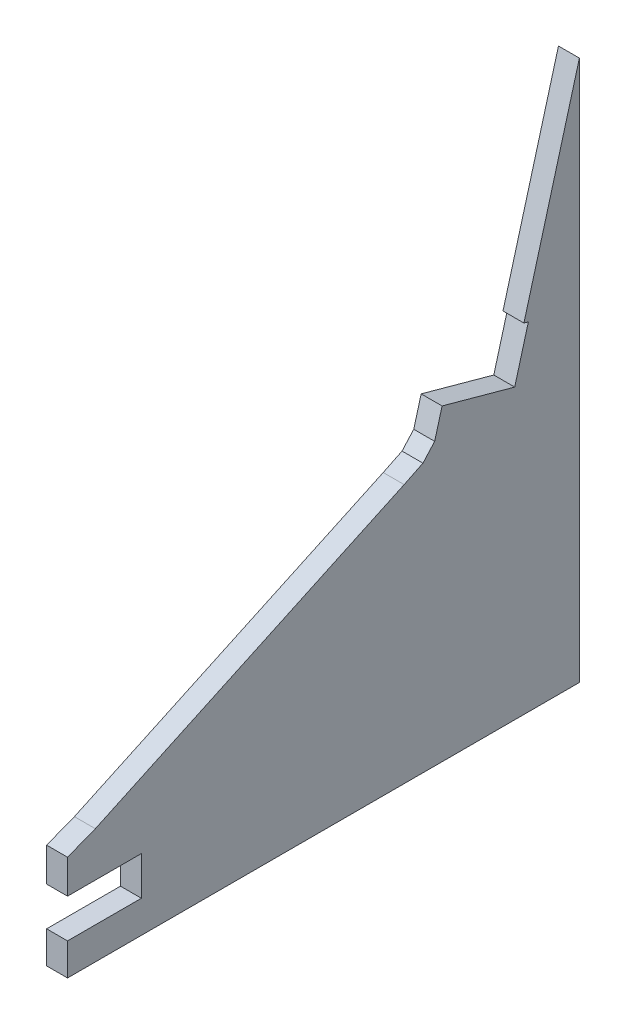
ISO-10303-21;
HEADER;
FILE_DESCRIPTION(('STEP AP214'),'2;1');
FILE_NAME('part.step','',(''),(''),'','','');
FILE_SCHEMA(('AUTOMOTIVE_DESIGN { 1 0 10303 214 1 1 1 1 }'));
ENDSEC;
DATA;
#1=APPLICATION_CONTEXT('core data for automotive mechanical design processes');
#2=APPLICATION_PROTOCOL_DEFINITION('international standard','automotive_design',2000,#1);
#3=PRODUCT_CONTEXT('',#1,'mechanical');
#4=PRODUCT('Part','Part','',(#3));
#5=PRODUCT_RELATED_PRODUCT_CATEGORY('part','',(#4));
#6=PRODUCT_DEFINITION_FORMATION('','',#4);
#7=PRODUCT_DEFINITION_CONTEXT('part definition',#1,'design');
#8=PRODUCT_DEFINITION('design','',#6,#7);
#9=PRODUCT_DEFINITION_SHAPE('','',#8);
#10=(LENGTH_UNIT() NAMED_UNIT(*) SI_UNIT(.MILLI.,.METRE.));
#11=(NAMED_UNIT(*) PLANE_ANGLE_UNIT() SI_UNIT($,.RADIAN.));
#12=(NAMED_UNIT(*) SI_UNIT($,.STERADIAN.) SOLID_ANGLE_UNIT());
#13=UNCERTAINTY_MEASURE_WITH_UNIT(LENGTH_MEASURE(1.E-05),#10,'distance_accuracy_value','');
#14=(GEOMETRIC_REPRESENTATION_CONTEXT(3) GLOBAL_UNCERTAINTY_ASSIGNED_CONTEXT((#13)) GLOBAL_UNIT_ASSIGNED_CONTEXT((#10,
#11,#12)) REPRESENTATION_CONTEXT('',''));
#15=CARTESIAN_POINT('',(0.,0.,0.));
#16=DIRECTION('',(0.,0.,1.));
#17=DIRECTION('',(1.,0.,0.));
#18=AXIS2_PLACEMENT_3D('',#15,#16,#17);
#19=CARTESIAN_POINT('',(10.,-748.435272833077,-112.051223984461));
#20=DIRECTION('',(0.,1.,0.));
#21=DIRECTION('',(0.,0.,1.));
#22=AXIS2_PLACEMENT_3D('',#19,#20,#21);
#23=PLANE('',#22);
#24=DIRECTION('',(0.,0.,-1.));
#25=VECTOR('',#24,1.);
#26=CARTESIAN_POINT('',(0.,-748.435272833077,-112.051223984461));
#27=LINE('',#26,#25);
#28=CARTESIAN_POINT('',(0.,-748.435272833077,132.594000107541));
#29=VERTEX_POINT('',#28);
#30=CARTESIAN_POINT('',(0.,-748.435272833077,-112.051223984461));
#31=VERTEX_POINT('',#30);
#32=EDGE_CURVE('E177',#29,#31,#27,.T.);
#33=ORIENTED_EDGE('',*,*,#32,.T.);
#34=DIRECTION('',(-1.,0.,0.));
#35=VECTOR('',#34,1.);
#36=CARTESIAN_POINT('',(10.,-748.435272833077,-112.051223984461));
#37=LINE('',#36,#35);
#38=CARTESIAN_POINT('',(10.,-748.435272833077,-112.051223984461));
#39=VERTEX_POINT('',#38);
#40=EDGE_CURVE('E11',#39,#31,#37,.T.);
#41=ORIENTED_EDGE('',*,*,#40,.F.);
#42=DIRECTION('',(0.,0.,-1.));
#43=VECTOR('',#42,1.);
#44=CARTESIAN_POINT('',(10.,-748.435272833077,-112.051223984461));
#45=LINE('',#44,#43);
#46=CARTESIAN_POINT('',(10.,-748.435272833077,132.594000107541));
#47=VERTEX_POINT('',#46);
#48=EDGE_CURVE('E207',#47,#39,#45,.T.);
#49=ORIENTED_EDGE('',*,*,#48,.F.);
#50=DIRECTION('',(-1.,0.,0.));
#51=VECTOR('',#50,1.);
#52=CARTESIAN_POINT('',(10.,-748.435272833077,132.594000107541));
#53=LINE('',#52,#51);
#54=EDGE_CURVE('E173',#47,#29,#53,.T.);
#55=ORIENTED_EDGE('',*,*,#54,.T.);
#56=EDGE_LOOP('',(#33,#41,#49,#55));
#57=FACE_BOUND('',#56,.T.);
#58=ADVANCED_FACE('F33',(#57),#23,.F.);
#59=CARTESIAN_POINT('',(10.,-489.980067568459,-112.051223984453));
#60=DIRECTION('',(0.,0.,1.));
#61=DIRECTION('',(0.,-1.,0.));
#62=AXIS2_PLACEMENT_3D('',#59,#60,#61);
#63=PLANE('',#62);
#64=DIRECTION('',(0.,1.,0.));
#65=VECTOR('',#64,1.);
#66=CARTESIAN_POINT('',(0.,-489.980067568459,-112.051223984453));
#67=LINE('',#66,#65);
#68=CARTESIAN_POINT('',(0.,-489.980067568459,-112.051223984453));
#69=VERTEX_POINT('',#68);
#70=EDGE_CURVE('E180',#31,#69,#67,.T.);
#71=ORIENTED_EDGE('',*,*,#70,.T.);
#72=DIRECTION('',(-1.,0.,0.));
#73=VECTOR('',#72,1.);
#74=CARTESIAN_POINT('',(10.,-489.980067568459,-112.051223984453));
#75=LINE('',#74,#73);
#76=CARTESIAN_POINT('',(10.,-489.980067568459,-112.051223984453));
#77=VERTEX_POINT('',#76);
#78=EDGE_CURVE('E41',#77,#69,#75,.T.);
#79=ORIENTED_EDGE('',*,*,#78,.F.);
#80=DIRECTION('',(0.,1.,0.));
#81=VECTOR('',#80,1.);
#82=CARTESIAN_POINT('',(10.,-489.980067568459,-112.051223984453));
#83=LINE('',#82,#81);
#84=EDGE_CURVE('E116',#39,#77,#83,.T.);
#85=ORIENTED_EDGE('',*,*,#84,.F.);
#86=ORIENTED_EDGE('',*,*,#40,.T.);
#87=EDGE_LOOP('',(#71,#79,#85,#86));
#88=FACE_BOUND('',#87,.T.);
#89=ADVANCED_FACE('F305',(#88),#63,.F.);
#90=CARTESIAN_POINT('',(10.,-489.980067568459,-112.051223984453));
#91=DIRECTION('',(0.,-0.265140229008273,-0.964209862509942));
#92=DIRECTION('',(0.,0.964209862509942,-0.265140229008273));
#93=AXIS2_PLACEMENT_3D('',#90,#91,#92);
#94=PLANE('',#93);
#95=DIRECTION('',(0.,-0.964209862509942,0.265140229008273));
#96=VECTOR('',#95,1.);
#97=CARTESIAN_POINT('',(0.,-489.980067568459,-112.051223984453));
#98=LINE('',#97,#96);
#99=CARTESIAN_POINT('',(0.,-586.401053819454,-85.5372010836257));
#100=VERTEX_POINT('',#99);
#101=EDGE_CURVE('E182',#69,#100,#98,.T.);
#102=ORIENTED_EDGE('',*,*,#101,.T.);
#103=DIRECTION('',(-1.,0.,0.));
#104=VECTOR('',#103,1.);
#105=CARTESIAN_POINT('',(10.,-586.401053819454,-85.5372010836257));
#106=LINE('',#105,#104);
#107=CARTESIAN_POINT('',(10.,-586.401053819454,-85.5372010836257));
#108=VERTEX_POINT('',#107);
#109=EDGE_CURVE('E238',#108,#100,#106,.T.);
#110=ORIENTED_EDGE('',*,*,#109,.F.);
#111=DIRECTION('',(0.,-0.964209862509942,0.265140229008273));
#112=VECTOR('',#111,1.);
#113=CARTESIAN_POINT('',(10.,-489.980067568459,-112.051223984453));
#114=LINE('',#113,#112);
#115=EDGE_CURVE('E246',#77,#108,#114,.T.);
#116=ORIENTED_EDGE('',*,*,#115,.F.);
#117=ORIENTED_EDGE('',*,*,#78,.T.);
#118=EDGE_LOOP('',(#102,#110,#116,#117));
#119=FACE_BOUND('',#118,.T.);
#120=ADVANCED_FACE('F244',(#119),#94,.F.);
#121=CARTESIAN_POINT('',(10.,-586.984361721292,-87.658460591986));
#122=DIRECTION('',(0.,0.964209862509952,-0.265140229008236));
#123=DIRECTION('',(0.,0.265140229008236,0.964209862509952));
#124=AXIS2_PLACEMENT_3D('',#121,#122,#123);
#125=PLANE('',#124);
#126=DIRECTION('',(0.,-0.265140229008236,-0.964209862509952));
#127=VECTOR('',#126,1.);
#128=CARTESIAN_POINT('',(0.,-586.984361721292,-87.658460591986));
#129=LINE('',#128,#127);
#130=CARTESIAN_POINT('',(0.,-586.984361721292,-87.658460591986));
#131=VERTEX_POINT('',#130);
#132=EDGE_CURVE('E184',#100,#131,#129,.T.);
#133=ORIENTED_EDGE('',*,*,#132,.T.);
#134=DIRECTION('',(-1.,0.,0.));
#135=VECTOR('',#134,1.);
#136=CARTESIAN_POINT('',(10.,-586.984361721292,-87.658460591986));
#137=LINE('',#136,#135);
#138=CARTESIAN_POINT('',(10.,-586.984361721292,-87.658460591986));
#139=VERTEX_POINT('',#138);
#140=EDGE_CURVE('E235',#139,#131,#137,.T.);
#141=ORIENTED_EDGE('',*,*,#140,.F.);
#142=DIRECTION('',(0.,-0.265140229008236,-0.964209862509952));
#143=VECTOR('',#142,1.);
#144=CARTESIAN_POINT('',(10.,-586.984361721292,-87.658460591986));
#145=LINE('',#144,#143);
#146=EDGE_CURVE('E264',#108,#139,#145,.T.);
#147=ORIENTED_EDGE('',*,*,#146,.F.);
#148=ORIENTED_EDGE('',*,*,#109,.T.);
#149=EDGE_LOOP('',(#133,#141,#147,#148));
#150=FACE_BOUND('',#149,.T.);
#151=ADVANCED_FACE('F255',(#150),#125,.F.);
#152=CARTESIAN_POINT('',(10.,-586.984361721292,-87.658460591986));
#153=DIRECTION('',(0.,-0.265140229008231,-0.964209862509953));
#154=DIRECTION('',(0.,0.964209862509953,-0.265140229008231));
#155=AXIS2_PLACEMENT_3D('',#152,#153,#154);
#156=PLANE('',#155);
#157=DIRECTION('',(0.,-0.964209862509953,0.265140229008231));
#158=VECTOR('',#157,1.);
#159=CARTESIAN_POINT('',(0.,-586.984361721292,-87.658460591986));
#160=LINE('',#159,#158);
#161=CARTESIAN_POINT('',(0.,-610.703922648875,-81.1360114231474));
#162=VERTEX_POINT('',#161);
#163=EDGE_CURVE('E186',#131,#162,#160,.T.);
#164=ORIENTED_EDGE('',*,*,#163,.T.);
#165=DIRECTION('',(-1.,0.,0.));
#166=VECTOR('',#165,1.);
#167=CARTESIAN_POINT('',(10.,-610.703922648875,-81.1360114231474));
#168=LINE('',#167,#166);
#169=CARTESIAN_POINT('',(10.,-610.703922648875,-81.1360114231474));
#170=VERTEX_POINT('',#169);
#171=EDGE_CURVE('E232',#170,#162,#168,.T.);
#172=ORIENTED_EDGE('',*,*,#171,.F.);
#173=DIRECTION('',(0.,-0.964209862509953,0.265140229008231));
#174=VECTOR('',#173,1.);
#175=CARTESIAN_POINT('',(10.,-586.984361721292,-87.658460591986));
#176=LINE('',#175,#174);
#177=EDGE_CURVE('E261',#139,#170,#176,.T.);
#178=ORIENTED_EDGE('',*,*,#177,.F.);
#179=ORIENTED_EDGE('',*,*,#140,.T.);
#180=EDGE_LOOP('',(#164,#172,#178,#179));
#181=FACE_BOUND('',#180,.T.);
#182=ADVANCED_FACE('F259',(#181),#156,.F.);
#183=CARTESIAN_POINT('',(10.,-610.703922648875,-81.1360114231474));
#184=DIRECTION('',(0.,-0.964209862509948,0.26514022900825));
#185=DIRECTION('',(0.,-0.26514022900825,-0.964209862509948));
#186=AXIS2_PLACEMENT_3D('',#183,#184,#185);
#187=PLANE('',#186);
#188=DIRECTION('',(0.,0.26514022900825,0.964209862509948));
#189=VECTOR('',#188,1.);
#190=CARTESIAN_POINT('',(0.,-610.703922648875,-81.1360114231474));
#191=LINE('',#190,#189);
#192=CARTESIAN_POINT('',(0.,-601.158874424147,-46.4244564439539));
#193=VERTEX_POINT('',#192);
#194=EDGE_CURVE('E188',#162,#193,#191,.T.);
#195=ORIENTED_EDGE('',*,*,#194,.T.);
#196=DIRECTION('',(-1.,0.,0.));
#197=VECTOR('',#196,1.);
#198=CARTESIAN_POINT('',(10.,-601.158874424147,-46.4244564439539));
#199=LINE('',#198,#197);
#200=CARTESIAN_POINT('',(10.,-601.158874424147,-46.4244564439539));
#201=VERTEX_POINT('',#200);
#202=EDGE_CURVE('E229',#201,#193,#199,.T.);
#203=ORIENTED_EDGE('',*,*,#202,.F.);
#204=DIRECTION('',(0.,0.26514022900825,0.964209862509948));
#205=VECTOR('',#204,1.);
#206=CARTESIAN_POINT('',(10.,-610.703922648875,-81.1360114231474));
#207=LINE('',#206,#205);
#208=EDGE_CURVE('E263',#170,#201,#207,.T.);
#209=ORIENTED_EDGE('',*,*,#208,.F.);
#210=ORIENTED_EDGE('',*,*,#171,.T.);
#211=EDGE_LOOP('',(#195,#203,#209,#210));
#212=FACE_BOUND('',#211,.T.);
#213=ADVANCED_FACE('F318',(#212),#187,.F.);
#214=CARTESIAN_POINT('',(10.,-601.158874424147,-46.4244564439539));
#215=DIRECTION('',(0.,-0.265140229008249,-0.964209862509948));
#216=DIRECTION('',(0.,0.964209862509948,-0.265140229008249));
#217=AXIS2_PLACEMENT_3D('',#214,#215,#216);
#218=PLANE('',#217);
#219=DIRECTION('',(0.,-0.964209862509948,0.265140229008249));
#220=VECTOR('',#219,1.);
#221=CARTESIAN_POINT('',(0.,-601.158874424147,-46.4244564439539));
#222=LINE('',#221,#220);
#223=CARTESIAN_POINT('',(0.,-614.040719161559,-42.8821827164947));
#224=VERTEX_POINT('',#223);
#225=EDGE_CURVE('E190',#193,#224,#222,.T.);
#226=ORIENTED_EDGE('',*,*,#225,.T.);
#227=DIRECTION('',(-1.,0.,0.));
#228=VECTOR('',#227,1.);
#229=CARTESIAN_POINT('',(10.,-614.040719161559,-42.8821827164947));
#230=LINE('',#229,#228);
#231=CARTESIAN_POINT('',(10.,-614.040719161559,-42.8821827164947));
#232=VERTEX_POINT('',#231);
#233=EDGE_CURVE('E226',#232,#224,#230,.T.);
#234=ORIENTED_EDGE('',*,*,#233,.F.);
#235=DIRECTION('',(0.,-0.964209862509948,0.265140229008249));
#236=VECTOR('',#235,1.);
#237=CARTESIAN_POINT('',(10.,-601.158874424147,-46.4244564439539));
#238=LINE('',#237,#236);
#239=EDGE_CURVE('E266',#201,#232,#238,.T.);
#240=ORIENTED_EDGE('',*,*,#239,.F.);
#241=ORIENTED_EDGE('',*,*,#202,.T.);
#242=EDGE_LOOP('',(#226,#234,#240,#241));
#243=FACE_BOUND('',#242,.T.);
#244=ADVANCED_FACE('F321',(#243),#218,.F.);
#245=CARTESIAN_POINT('',(10.,-614.040719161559,-42.8821827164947));
#246=DIRECTION('',(0.,-0.668355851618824,-0.743841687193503));
#247=DIRECTION('',(0.,0.743841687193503,-0.668355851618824));
#248=AXIS2_PLACEMENT_3D('',#245,#246,#247);
#249=PLANE('',#248);
#250=DIRECTION('',(0.,-0.743841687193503,0.668355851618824));
#251=VECTOR('',#250,1.);
#252=CARTESIAN_POINT('',(0.,-614.040719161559,-42.8821827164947));
#253=LINE('',#252,#251);
#254=CARTESIAN_POINT('',(0.,-620.270284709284,-37.284800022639));
#255=VERTEX_POINT('',#254);
#256=EDGE_CURVE('E192',#224,#255,#253,.T.);
#257=ORIENTED_EDGE('',*,*,#256,.T.);
#258=DIRECTION('',(-1.,0.,0.));
#259=VECTOR('',#258,1.);
#260=CARTESIAN_POINT('',(10.,-620.270284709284,-37.284800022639));
#261=LINE('',#260,#259);
#262=CARTESIAN_POINT('',(10.,-620.270284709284,-37.284800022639));
#263=VERTEX_POINT('',#262);
#264=EDGE_CURVE('E223',#263,#255,#261,.T.);
#265=ORIENTED_EDGE('',*,*,#264,.F.);
#266=DIRECTION('',(0.,-0.743841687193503,0.668355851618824));
#267=VECTOR('',#266,1.);
#268=CARTESIAN_POINT('',(10.,-614.040719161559,-42.8821827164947));
#269=LINE('',#268,#267);
#270=EDGE_CURVE('E272',#232,#263,#269,.T.);
#271=ORIENTED_EDGE('',*,*,#270,.F.);
#272=ORIENTED_EDGE('',*,*,#233,.T.);
#273=EDGE_LOOP('',(#257,#265,#271,#272));
#274=FACE_BOUND('',#273,.T.);
#275=ADVANCED_FACE('F325',(#274),#249,.F.);
#276=CARTESIAN_POINT('',(10.,-624.646577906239,-28.2932452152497));
#277=DIRECTION('',(0.,-0.899155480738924,-0.437629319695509));
#278=DIRECTION('',(0.,0.437629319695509,-0.899155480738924));
#279=AXIS2_PLACEMENT_3D('',#276,#277,#278);
#280=PLANE('',#279);
#281=DIRECTION('',(0.,-0.437629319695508,0.899155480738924));
#282=VECTOR('',#281,1.);
#283=CARTESIAN_POINT('',(0.,-624.646577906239,-28.2932452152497));
#284=LINE('',#283,#282);
#285=CARTESIAN_POINT('',(0.,-624.646577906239,-28.2932452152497));
#286=VERTEX_POINT('',#285);
#287=EDGE_CURVE('E194',#255,#286,#284,.T.);
#288=ORIENTED_EDGE('',*,*,#287,.T.);
#289=DIRECTION('',(-1.,0.,0.));
#290=VECTOR('',#289,1.);
#291=CARTESIAN_POINT('',(10.,-624.646577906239,-28.2932452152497));
#292=LINE('',#291,#290);
#293=CARTESIAN_POINT('',(10.,-624.646577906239,-28.2932452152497));
#294=VERTEX_POINT('',#293);
#295=EDGE_CURVE('E220',#294,#286,#292,.T.);
#296=ORIENTED_EDGE('',*,*,#295,.F.);
#297=DIRECTION('',(0.,-0.437629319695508,0.899155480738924));
#298=VECTOR('',#297,1.);
#299=CARTESIAN_POINT('',(10.,-624.646577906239,-28.2932452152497));
#300=LINE('',#299,#298);
#301=EDGE_CURVE('E274',#263,#294,#300,.T.);
#302=ORIENTED_EDGE('',*,*,#301,.F.);
#303=ORIENTED_EDGE('',*,*,#264,.T.);
#304=EDGE_LOOP('',(#288,#296,#302,#303));
#305=FACE_BOUND('',#304,.T.);
#306=ADVANCED_FACE('F329',(#305),#280,.F.);
#307=CARTESIAN_POINT('',(10.,-624.646577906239,-28.2932452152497));
#308=DIRECTION('',(0.,-0.90675172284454,-0.42166492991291));
#309=DIRECTION('',(0.,0.42166492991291,-0.90675172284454));
#310=AXIS2_PLACEMENT_3D('',#307,#308,#309);
#311=PLANE('',#310);
#312=DIRECTION('',(0.,-0.42166492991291,0.906751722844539));
#313=VECTOR('',#312,1.);
#314=CARTESIAN_POINT('',(0.,-624.646577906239,-28.2932452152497));
#315=LINE('',#314,#313);
#316=CARTESIAN_POINT('',(0.,-693.286140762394,119.309833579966));
#317=VERTEX_POINT('',#316);
#318=EDGE_CURVE('E196',#286,#317,#315,.T.);
#319=ORIENTED_EDGE('',*,*,#318,.T.);
#320=DIRECTION('',(-1.,0.,0.));
#321=VECTOR('',#320,1.);
#322=CARTESIAN_POINT('',(10.,-693.286140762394,119.309833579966));
#323=LINE('',#322,#321);
#324=CARTESIAN_POINT('',(10.,-693.286140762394,119.309833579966));
#325=VERTEX_POINT('',#324);
#326=EDGE_CURVE('E217',#325,#317,#323,.T.);
#327=ORIENTED_EDGE('',*,*,#326,.F.);
#328=DIRECTION('',(0.,-0.42166492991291,0.906751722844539));
#329=VECTOR('',#328,1.);
#330=CARTESIAN_POINT('',(10.,-624.646577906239,-28.2932452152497));
#331=LINE('',#330,#329);
#332=EDGE_CURVE('E276',#294,#325,#331,.T.);
#333=ORIENTED_EDGE('',*,*,#332,.F.);
#334=ORIENTED_EDGE('',*,*,#295,.T.);
#335=EDGE_LOOP('',(#319,#327,#333,#334));
#336=FACE_BOUND('',#335,.T.);
#337=ADVANCED_FACE('F333',(#336),#311,.F.);
#338=CARTESIAN_POINT('',(10.,-693.286140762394,119.309833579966));
#339=DIRECTION('',(0.,-0.93240557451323,-0.361413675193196));
#340=DIRECTION('',(0.,0.361413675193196,-0.93240557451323));
#341=AXIS2_PLACEMENT_3D('',#338,#339,#340);
#342=PLANE('',#341);
#343=DIRECTION('',(0.,-0.361413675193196,0.93240557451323));
#344=VECTOR('',#343,1.);
#345=CARTESIAN_POINT('',(0.,-693.286140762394,119.309833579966));
#346=LINE('',#345,#344);
#347=CARTESIAN_POINT('',(0.,-698.435272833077,132.594000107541));
#348=VERTEX_POINT('',#347);
#349=EDGE_CURVE('E198',#317,#348,#346,.T.);
#350=ORIENTED_EDGE('',*,*,#349,.T.);
#351=DIRECTION('',(-1.,0.,0.));
#352=VECTOR('',#351,1.);
#353=CARTESIAN_POINT('',(10.,-698.435272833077,132.594000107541));
#354=LINE('',#353,#352);
#355=CARTESIAN_POINT('',(10.,-698.435272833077,132.594000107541));
#356=VERTEX_POINT('',#355);
#357=EDGE_CURVE('E214',#356,#348,#354,.T.);
#358=ORIENTED_EDGE('',*,*,#357,.F.);
#359=DIRECTION('',(0.,-0.361413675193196,0.93240557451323));
#360=VECTOR('',#359,1.);
#361=CARTESIAN_POINT('',(10.,-693.286140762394,119.309833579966));
#362=LINE('',#361,#360);
#363=EDGE_CURVE('E278',#325,#356,#362,.T.);
#364=ORIENTED_EDGE('',*,*,#363,.F.);
#365=ORIENTED_EDGE('',*,*,#326,.T.);
#366=EDGE_LOOP('',(#350,#358,#364,#365));
#367=FACE_BOUND('',#366,.T.);
#368=ADVANCED_FACE('F337',(#367),#342,.F.);
#369=CARTESIAN_POINT('',(10.,-698.435272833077,132.594000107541));
#370=DIRECTION('',(0.,0.,-1.));
#371=DIRECTION('',(-1.,0.,0.));
#372=AXIS2_PLACEMENT_3D('',#369,#370,#371);
#373=PLANE('',#372);
#374=DIRECTION('',(0.,-1.,0.));
#375=VECTOR('',#374,1.);
#376=CARTESIAN_POINT('',(0.,-698.435272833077,132.594000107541));
#377=LINE('',#376,#375);
#378=CARTESIAN_POINT('',(0.,-714.571297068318,132.594000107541));
#379=VERTEX_POINT('',#378);
#380=EDGE_CURVE('E200',#348,#379,#377,.T.);
#381=ORIENTED_EDGE('',*,*,#380,.T.);
#382=DIRECTION('',(-1.,0.,0.));
#383=VECTOR('',#382,1.);
#384=CARTESIAN_POINT('',(10.,-714.571297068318,132.594000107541));
#385=LINE('',#384,#383);
#386=CARTESIAN_POINT('',(10.,-714.571297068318,132.594000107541));
#387=VERTEX_POINT('',#386);
#388=EDGE_CURVE('E211',#387,#379,#385,.T.);
#389=ORIENTED_EDGE('',*,*,#388,.F.);
#390=DIRECTION('',(0.,-1.,0.));
#391=VECTOR('',#390,1.);
#392=CARTESIAN_POINT('',(10.,-698.435272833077,132.594000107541));
#393=LINE('',#392,#391);
#394=EDGE_CURVE('E280',#356,#387,#393,.T.);
#395=ORIENTED_EDGE('',*,*,#394,.F.);
#396=ORIENTED_EDGE('',*,*,#357,.T.);
#397=EDGE_LOOP('',(#381,#389,#395,#396));
#398=FACE_BOUND('',#397,.T.);
#399=ADVANCED_FACE('F286',(#398),#373,.F.);
#400=CARTESIAN_POINT('',(10.,-714.571297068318,97.2940001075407));
#401=DIRECTION('',(0.,1.,0.));
#402=DIRECTION('',(0.,0.,1.));
#403=AXIS2_PLACEMENT_3D('',#400,#401,#402);
#404=PLANE('',#403);
#405=DIRECTION('',(0.,0.,-1.));
#406=VECTOR('',#405,1.);
#407=CARTESIAN_POINT('',(0.,-714.571297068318,97.2940001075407));
#408=LINE('',#407,#406);
#409=CARTESIAN_POINT('',(0.,-714.571297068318,97.2940001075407));
#410=VERTEX_POINT('',#409);
#411=EDGE_CURVE('E202',#379,#410,#408,.T.);
#412=ORIENTED_EDGE('',*,*,#411,.T.);
#413=DIRECTION('',(-1.,0.,0.));
#414=VECTOR('',#413,1.);
#415=CARTESIAN_POINT('',(10.,-714.571297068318,97.2940001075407));
#416=LINE('',#415,#414);
#417=CARTESIAN_POINT('',(10.,-714.571297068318,97.2940001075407));
#418=VERTEX_POINT('',#417);
#419=EDGE_CURVE('E168',#418,#410,#416,.T.);
#420=ORIENTED_EDGE('',*,*,#419,.F.);
#421=DIRECTION('',(0.,0.,-1.));
#422=VECTOR('',#421,1.);
#423=CARTESIAN_POINT('',(10.,-714.571297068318,97.2940001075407));
#424=LINE('',#423,#422);
#425=EDGE_CURVE('E159',#387,#418,#424,.T.);
#426=ORIENTED_EDGE('',*,*,#425,.F.);
#427=ORIENTED_EDGE('',*,*,#388,.T.);
#428=EDGE_LOOP('',(#412,#420,#426,#427));
#429=FACE_BOUND('',#428,.T.);
#430=ADVANCED_FACE('F290',(#429),#404,.F.);
#431=CARTESIAN_POINT('',(10.,-714.571297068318,97.2940001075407));
#432=DIRECTION('',(0.,0.,-1.));
#433=DIRECTION('',(-1.,0.,0.));
#434=AXIS2_PLACEMENT_3D('',#431,#432,#433);
#435=PLANE('',#434);
#436=DIRECTION('',(0.,-1.,0.));
#437=VECTOR('',#436,1.);
#438=CARTESIAN_POINT('',(0.,-714.571297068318,97.2940001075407));
#439=LINE('',#438,#437);
#440=CARTESIAN_POINT('',(0.,-733.071297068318,97.2940001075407));
#441=VERTEX_POINT('',#440);
#442=EDGE_CURVE('E167',#410,#441,#439,.T.);
#443=ORIENTED_EDGE('',*,*,#442,.T.);
#444=DIRECTION('',(-1.,0.,0.));
#445=VECTOR('',#444,1.);
#446=CARTESIAN_POINT('',(10.,-733.071297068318,97.2940001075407));
#447=LINE('',#446,#445);
#448=CARTESIAN_POINT('',(10.,-733.071297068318,97.2940001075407));
#449=VERTEX_POINT('',#448);
#450=EDGE_CURVE('E164',#449,#441,#447,.T.);
#451=ORIENTED_EDGE('',*,*,#450,.F.);
#452=DIRECTION('',(0.,-1.,0.));
#453=VECTOR('',#452,1.);
#454=CARTESIAN_POINT('',(10.,-714.571297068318,97.2940001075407));
#455=LINE('',#454,#453);
#456=EDGE_CURVE('E153',#418,#449,#455,.T.);
#457=ORIENTED_EDGE('',*,*,#456,.F.);
#458=ORIENTED_EDGE('',*,*,#419,.T.);
#459=EDGE_LOOP('',(#443,#451,#457,#458));
#460=FACE_BOUND('',#459,.T.);
#461=ADVANCED_FACE('F165',(#460),#435,.F.);
#462=CARTESIAN_POINT('',(10.,-733.071297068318,97.2940001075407));
#463=DIRECTION('',(0.,-1.,0.));
#464=DIRECTION('',(0.,0.,-1.));
#465=AXIS2_PLACEMENT_3D('',#462,#463,#464);
#466=PLANE('',#465);
#467=DIRECTION('',(0.,0.,1.));
#468=VECTOR('',#467,1.);
#469=CARTESIAN_POINT('',(0.,-733.071297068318,97.2940001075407));
#470=LINE('',#469,#468);
#471=CARTESIAN_POINT('',(0.,-733.071297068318,132.594000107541));
#472=VERTEX_POINT('',#471);
#473=EDGE_CURVE('E102',#441,#472,#470,.T.);
#474=ORIENTED_EDGE('',*,*,#473,.T.);
#475=DIRECTION('',(-1.,0.,0.));
#476=VECTOR('',#475,1.);
#477=CARTESIAN_POINT('',(10.,-733.071297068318,132.594000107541));
#478=LINE('',#477,#476);
#479=CARTESIAN_POINT('',(10.,-733.071297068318,132.594000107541));
#480=VERTEX_POINT('',#479);
#481=EDGE_CURVE('E169',#480,#472,#478,.T.);
#482=ORIENTED_EDGE('',*,*,#481,.F.);
#483=DIRECTION('',(0.,0.,1.));
#484=VECTOR('',#483,1.);
#485=CARTESIAN_POINT('',(10.,-733.071297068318,97.2940001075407));
#486=LINE('',#485,#484);
#487=EDGE_CURVE('E157',#449,#480,#486,.T.);
#488=ORIENTED_EDGE('',*,*,#487,.F.);
#489=ORIENTED_EDGE('',*,*,#450,.T.);
#490=EDGE_LOOP('',(#474,#482,#488,#489));
#491=FACE_BOUND('',#490,.T.);
#492=ADVANCED_FACE('F171',(#491),#466,.F.);
#493=CARTESIAN_POINT('',(10.,-733.071297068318,132.594000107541));
#494=DIRECTION('',(0.,0.,-1.));
#495=DIRECTION('',(0.,1.,0.));
#496=AXIS2_PLACEMENT_3D('',#493,#494,#495);
#497=PLANE('',#496);
#498=DIRECTION('',(0.,-1.,0.));
#499=VECTOR('',#498,1.);
#500=CARTESIAN_POINT('',(0.,-733.071297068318,132.594000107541));
#501=LINE('',#500,#499);
#502=EDGE_CURVE('E108',#472,#29,#501,.T.);
#503=ORIENTED_EDGE('',*,*,#502,.T.);
#504=ORIENTED_EDGE('',*,*,#54,.F.);
#505=DIRECTION('',(0.,-1.,0.));
#506=VECTOR('',#505,1.);
#507=CARTESIAN_POINT('',(10.,-733.071297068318,132.594000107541));
#508=LINE('',#507,#506);
#509=EDGE_CURVE('E49',#480,#47,#508,.T.);
#510=ORIENTED_EDGE('',*,*,#509,.F.);
#511=ORIENTED_EDGE('',*,*,#481,.T.);
#512=EDGE_LOOP('',(#503,#504,#510,#511));
#513=FACE_BOUND('',#512,.T.);
#514=ADVANCED_FACE('F294',(#513),#497,.F.);
#515=CARTESIAN_POINT('',(10.,0.,0.));
#516=DIRECTION('',(1.,0.,0.));
#517=DIRECTION('',(0.,0.,-1.));
#518=AXIS2_PLACEMENT_3D('',#515,#516,#517);
#519=PLANE('',#518);
#520=ORIENTED_EDGE('',*,*,#48,.T.);
#521=ORIENTED_EDGE('',*,*,#84,.T.);
#522=ORIENTED_EDGE('',*,*,#115,.T.);
#523=ORIENTED_EDGE('',*,*,#146,.T.);
#524=ORIENTED_EDGE('',*,*,#177,.T.);
#525=ORIENTED_EDGE('',*,*,#208,.T.);
#526=ORIENTED_EDGE('',*,*,#239,.T.);
#527=ORIENTED_EDGE('',*,*,#270,.T.);
#528=ORIENTED_EDGE('',*,*,#301,.T.);
#529=ORIENTED_EDGE('',*,*,#332,.T.);
#530=ORIENTED_EDGE('',*,*,#363,.T.);
#531=ORIENTED_EDGE('',*,*,#394,.T.);
#532=ORIENTED_EDGE('',*,*,#425,.T.);
#533=ORIENTED_EDGE('',*,*,#456,.T.);
#534=ORIENTED_EDGE('',*,*,#487,.T.);
#535=ORIENTED_EDGE('',*,*,#509,.T.);
#536=EDGE_LOOP('',(#520,#521,#522,#523,#524,#525,#526,#527,#528,#529,#530,#531,#532,#533,#534,#535));
#537=FACE_BOUND('',#536,.T.);
#538=ADVANCED_FACE('F155',(#537),#519,.T.);
#539=CARTESIAN_POINT('',(0.,0.,0.));
#540=DIRECTION('',(1.,0.,0.));
#541=DIRECTION('',(0.,0.,-1.));
#542=AXIS2_PLACEMENT_3D('',#539,#540,#541);
#543=PLANE('',#542);
#544=ORIENTED_EDGE('',*,*,#32,.F.);
#545=ORIENTED_EDGE('',*,*,#502,.F.);
#546=ORIENTED_EDGE('',*,*,#473,.F.);
#547=ORIENTED_EDGE('',*,*,#442,.F.);
#548=ORIENTED_EDGE('',*,*,#411,.F.);
#549=ORIENTED_EDGE('',*,*,#380,.F.);
#550=ORIENTED_EDGE('',*,*,#349,.F.);
#551=ORIENTED_EDGE('',*,*,#318,.F.);
#552=ORIENTED_EDGE('',*,*,#287,.F.);
#553=ORIENTED_EDGE('',*,*,#256,.F.);
#554=ORIENTED_EDGE('',*,*,#225,.F.);
#555=ORIENTED_EDGE('',*,*,#194,.F.);
#556=ORIENTED_EDGE('',*,*,#163,.F.);
#557=ORIENTED_EDGE('',*,*,#132,.F.);
#558=ORIENTED_EDGE('',*,*,#101,.F.);
#559=ORIENTED_EDGE('',*,*,#70,.F.);
#560=EDGE_LOOP('',(#544,#545,#546,#547,#548,#549,#550,#551,#552,#553,#554,#555,#556,#557,#558,#559));
#561=FACE_BOUND('',#560,.T.);
#562=ADVANCED_FACE('F250',(#561),#543,.F.);
#563=CLOSED_SHELL('',(#58,#89,#120,#151,#182,#213,#244,#275,#306,#337,#368,#399,#430,#461,#492,
#514,#538,#562));
#564=MANIFOLD_SOLID_BREP('B2',#563);
#565=ADVANCED_BREP_SHAPE_REPRESENTATION('',(#18,#564),#14);
#566=SHAPE_DEFINITION_REPRESENTATION(#9,#565);
ENDSEC;
END-ISO-10303-21;
